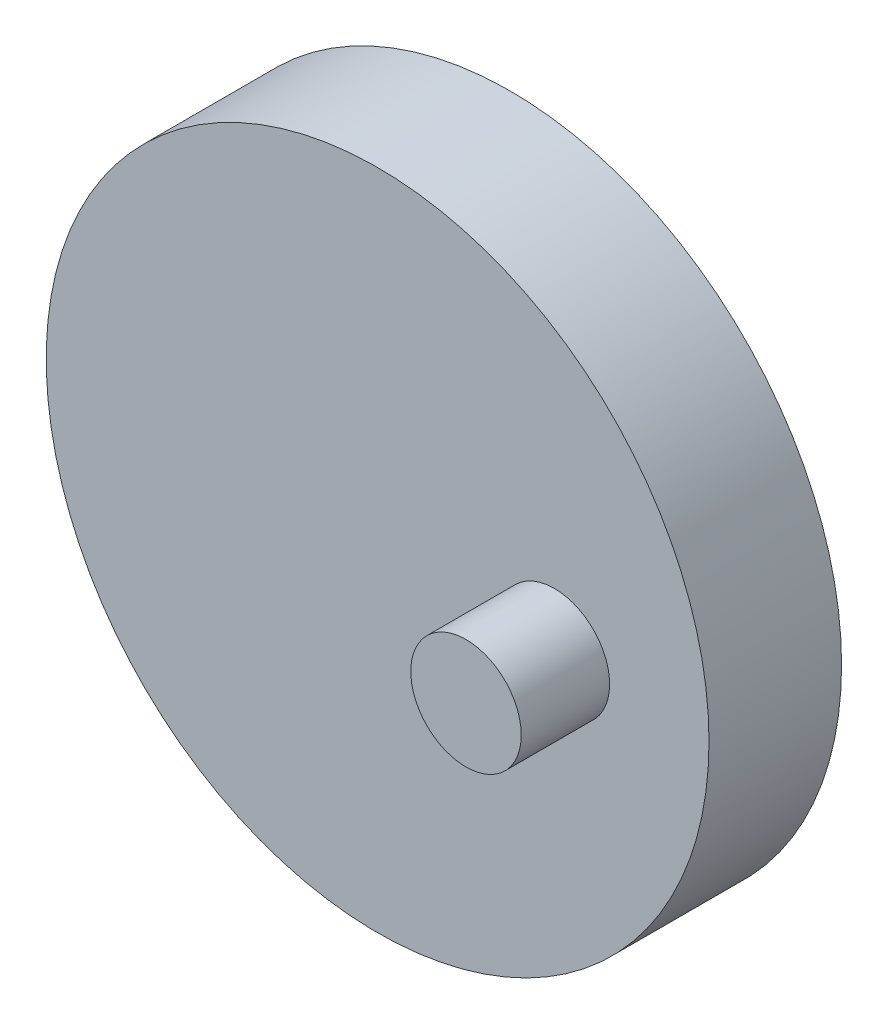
from build123d import *

# Parameters (mm, degrees)
ESQUISSE1_R      = 15
EXTRUSION1_DEPTH = 30
ESQUISSE2_R      = 75
EXTRUSION2_DEPTH = 30
ESQUISSE3_R      = 12.5
EXTRUSION3_DEPTH = 20


with BuildPart() as part:
    # Esquisse1 → Extrusion1 (new body)
    with BuildSketch(Plane.XY):
        with Locations((715, 40)):
            Circle(ESQUISSE1_R)
    extrude(amount=-EXTRUSION1_DEPTH)

    # Esquisse2 → Extrusion2 (add)
    with BuildSketch(Plane.XY):
        with Locations((715, 40)):
            Circle(ESQUISSE2_R)
    extrude(amount=EXTRUSION2_DEPTH)

    # Esquisse3 → Extrusion3 (add)
    with BuildSketch(Plane.XY.offset(30)):
        with Locations((755, 40)):
            Circle(ESQUISSE3_R)
    extrude(amount=EXTRUSION3_DEPTH)


solid = part.part
